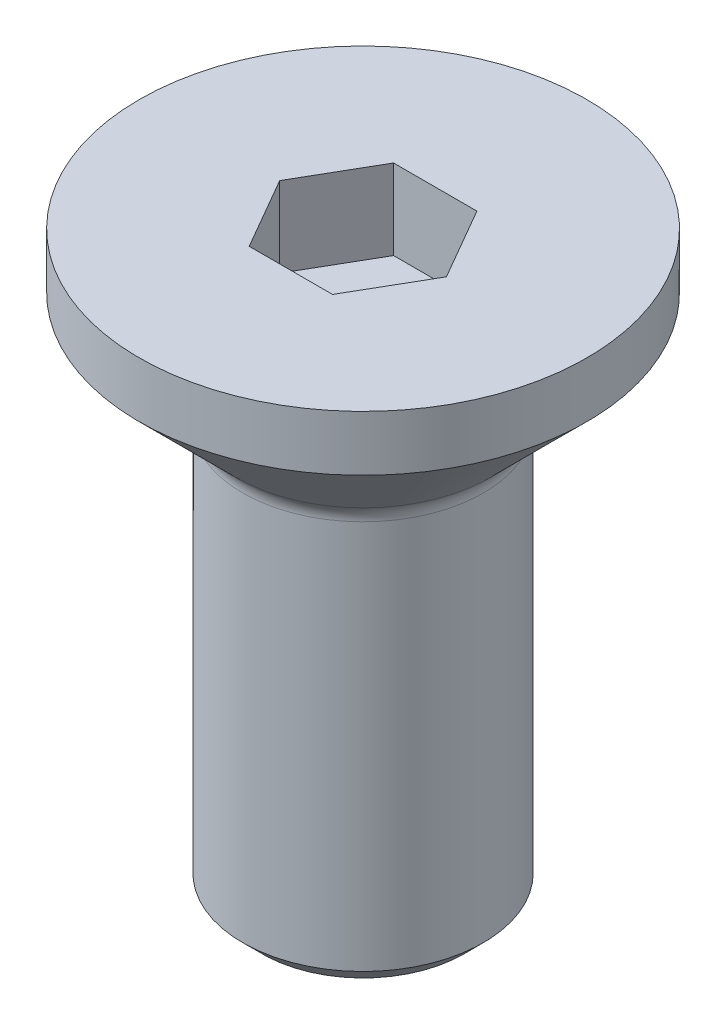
ISO-10303-21;
HEADER;
FILE_DESCRIPTION(('STEP AP214'),'2;1');
FILE_NAME('part.step','',(''),(''),'','','');
FILE_SCHEMA(('AUTOMOTIVE_DESIGN { 1 0 10303 214 1 1 1 1 }'));
ENDSEC;
DATA;
#1=APPLICATION_CONTEXT('core data for automotive mechanical design processes');
#2=APPLICATION_PROTOCOL_DEFINITION('international standard','automotive_design',2000,#1);
#3=PRODUCT_CONTEXT('',#1,'mechanical');
#4=PRODUCT('Part','Part','',(#3));
#5=PRODUCT_RELATED_PRODUCT_CATEGORY('part','',(#4));
#6=PRODUCT_DEFINITION_FORMATION('','',#4);
#7=PRODUCT_DEFINITION_CONTEXT('part definition',#1,'design');
#8=PRODUCT_DEFINITION('design','',#6,#7);
#9=PRODUCT_DEFINITION_SHAPE('','',#8);
#10=(LENGTH_UNIT() NAMED_UNIT(*) SI_UNIT(.MILLI.,.METRE.));
#11=(NAMED_UNIT(*) PLANE_ANGLE_UNIT() SI_UNIT($,.RADIAN.));
#12=(NAMED_UNIT(*) SI_UNIT($,.STERADIAN.) SOLID_ANGLE_UNIT());
#13=UNCERTAINTY_MEASURE_WITH_UNIT(LENGTH_MEASURE(1.E-05),#10,'distance_accuracy_value','');
#14=(GEOMETRIC_REPRESENTATION_CONTEXT(3) GLOBAL_UNCERTAINTY_ASSIGNED_CONTEXT((#13)) GLOBAL_UNIT_ASSIGNED_CONTEXT((#10,
#11,#12)) REPRESENTATION_CONTEXT('',''));
#15=CARTESIAN_POINT('',(0.,0.,0.));
#16=DIRECTION('',(0.,0.,1.));
#17=DIRECTION('',(1.,0.,0.));
#18=AXIS2_PLACEMENT_3D('',#15,#16,#17);
#19=CARTESIAN_POINT('',(0.,-3.50710678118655,0.));
#20=DIRECTION('',(0.,1.,0.));
#21=DIRECTION('',(-1.,0.,0.));
#22=AXIS2_PLACEMENT_3D('',#19,#20,#21);
#23=TOROIDAL_SURFACE('',#22,3.,0.499999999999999);
#24=CARTESIAN_POINT('',(0.,-3.15355339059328,0.));
#25=DIRECTION('',(0.,1.,0.));
#26=DIRECTION('',(-1.,0.,0.));
#27=AXIS2_PLACEMENT_3D('',#24,#25,#26);
#28=CIRCLE('',#27,2.64644660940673);
#29=CARTESIAN_POINT('',(-2.64644660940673,-3.15355339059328,0.));
#30=VERTEX_POINT('',#29);
#31=EDGE_CURVE('E11',#30,#30,#28,.T.);
#32=ORIENTED_EDGE('',*,*,#31,.F.);
#33=EDGE_LOOP('',(#32));
#34=FACE_BOUND('',#33,.T.);
#35=CARTESIAN_POINT('',(0.,-3.50710678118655,0.));
#36=DIRECTION('',(0.,1.,0.));
#37=DIRECTION('',(-1.,0.,0.));
#38=AXIS2_PLACEMENT_3D('',#35,#36,#37);
#39=CIRCLE('',#38,2.5);
#40=CARTESIAN_POINT('',(-2.5,-3.50710678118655,0.));
#41=VERTEX_POINT('',#40);
#42=EDGE_CURVE('E140',#41,#41,#39,.T.);
#43=ORIENTED_EDGE('',*,*,#42,.T.);
#44=EDGE_LOOP('',(#43));
#45=FACE_BOUND('',#44,.T.);
#46=ADVANCED_FACE('F39',(#34,#45),#23,.F.);
#47=CARTESIAN_POINT('',(0.,-3.15355339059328,0.));
#48=DIRECTION('',(0.,1.,0.));
#49=DIRECTION('',(-1.,0.,0.));
#50=AXIS2_PLACEMENT_3D('',#47,#48,#49);
#51=CONICAL_SURFACE('',#50,2.64644660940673,0.78539816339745);
#52=CARTESIAN_POINT('',(0.,-1.15000000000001,0.));
#53=DIRECTION('',(0.,1.,0.));
#54=DIRECTION('',(-1.,0.,0.));
#55=AXIS2_PLACEMENT_3D('',#52,#53,#54);
#56=CIRCLE('',#55,4.65);
#57=CARTESIAN_POINT('',(-4.65,-1.15000000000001,0.));
#58=VERTEX_POINT('',#57);
#59=EDGE_CURVE('E46',#58,#58,#56,.T.);
#60=ORIENTED_EDGE('',*,*,#59,.F.);
#61=EDGE_LOOP('',(#60));
#62=FACE_BOUND('',#61,.T.);
#63=ORIENTED_EDGE('',*,*,#31,.T.);
#64=EDGE_LOOP('',(#63));
#65=FACE_BOUND('',#64,.T.);
#66=ADVANCED_FACE('F161',(#62,#65),#51,.T.);
#67=CARTESIAN_POINT('',(0.,0.,0.));
#68=DIRECTION('',(0.,1.,0.));
#69=DIRECTION('',(-1.,0.,0.));
#70=AXIS2_PLACEMENT_3D('',#67,#68,#69);
#71=CYLINDRICAL_SURFACE('',#70,4.65);
#72=CARTESIAN_POINT('',(0.,0.,0.));
#73=DIRECTION('',(0.,1.,0.));
#74=DIRECTION('',(-1.,0.,0.));
#75=AXIS2_PLACEMENT_3D('',#72,#73,#74);
#76=CIRCLE('',#75,4.65);
#77=CARTESIAN_POINT('',(-4.65,0.,0.));
#78=VERTEX_POINT('',#77);
#79=EDGE_CURVE('E154',#78,#78,#76,.T.);
#80=ORIENTED_EDGE('',*,*,#79,.F.);
#81=EDGE_LOOP('',(#80));
#82=FACE_BOUND('',#81,.T.);
#83=ORIENTED_EDGE('',*,*,#59,.T.);
#84=EDGE_LOOP('',(#83));
#85=FACE_BOUND('',#84,.T.);
#86=ADVANCED_FACE('F159',(#82,#85),#71,.T.);
#87=CARTESIAN_POINT('',(4.65,0.,0.));
#88=DIRECTION('',(0.,-1.,0.));
#89=DIRECTION('',(1.,0.,0.));
#90=AXIS2_PLACEMENT_3D('',#87,#88,#89);
#91=PLANE('',#90);
#92=DIRECTION('',(-0.5,0.,-0.866025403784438));
#93=VECTOR('',#92,1.);
#94=CARTESIAN_POINT('',(1.73205080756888,0.,0.));
#95=LINE('',#94,#93);
#96=CARTESIAN_POINT('',(1.73205080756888,0.,0.));
#97=VERTEX_POINT('',#96);
#98=CARTESIAN_POINT('',(0.866025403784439,0.,-1.5));
#99=VERTEX_POINT('',#98);
#100=EDGE_CURVE('E127',#97,#99,#95,.T.);
#101=ORIENTED_EDGE('',*,*,#100,.F.);
#102=DIRECTION('',(0.5,0.,-0.866025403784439));
#103=VECTOR('',#102,1.);
#104=CARTESIAN_POINT('',(0.86602540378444,0.,1.5));
#105=LINE('',#104,#103);
#106=CARTESIAN_POINT('',(0.86602540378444,0.,1.5));
#107=VERTEX_POINT('',#106);
#108=EDGE_CURVE('E53',#107,#97,#105,.T.);
#109=ORIENTED_EDGE('',*,*,#108,.F.);
#110=DIRECTION('',(1.,0.,0.));
#111=VECTOR('',#110,1.);
#112=CARTESIAN_POINT('',(-0.866025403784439,0.,1.5));
#113=LINE('',#112,#111);
#114=CARTESIAN_POINT('',(-0.866025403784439,0.,1.5));
#115=VERTEX_POINT('',#114);
#116=EDGE_CURVE('E136',#115,#107,#113,.T.);
#117=ORIENTED_EDGE('',*,*,#116,.F.);
#118=DIRECTION('',(0.5,0.,0.866025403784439));
#119=VECTOR('',#118,1.);
#120=CARTESIAN_POINT('',(-1.73205080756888,0.,0.));
#121=LINE('',#120,#119);
#122=CARTESIAN_POINT('',(-1.73205080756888,0.,0.));
#123=VERTEX_POINT('',#122);
#124=EDGE_CURVE('E134',#123,#115,#121,.T.);
#125=ORIENTED_EDGE('',*,*,#124,.F.);
#126=DIRECTION('',(-0.5,0.,0.866025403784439));
#127=VECTOR('',#126,1.);
#128=CARTESIAN_POINT('',(-0.866025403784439,0.,-1.5));
#129=LINE('',#128,#127);
#130=CARTESIAN_POINT('',(-0.866025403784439,0.,-1.5));
#131=VERTEX_POINT('',#130);
#132=EDGE_CURVE('E101',#131,#123,#129,.T.);
#133=ORIENTED_EDGE('',*,*,#132,.F.);
#134=DIRECTION('',(-1.,0.,0.));
#135=VECTOR('',#134,1.);
#136=CARTESIAN_POINT('',(0.866025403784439,0.,-1.5));
#137=LINE('',#136,#135);
#138=EDGE_CURVE('E130',#99,#131,#137,.T.);
#139=ORIENTED_EDGE('',*,*,#138,.F.);
#140=EDGE_LOOP('',(#101,#109,#117,#125,#133,#139));
#141=FACE_BOUND('',#140,.T.);
#142=ORIENTED_EDGE('',*,*,#79,.T.);
#143=EDGE_LOOP('',(#142));
#144=FACE_BOUND('',#143,.T.);
#145=ADVANCED_FACE('F185',(#141,#144),#91,.F.);
#146=CARTESIAN_POINT('',(2.1,-12.,0.));
#147=DIRECTION('',(0.,1.,0.));
#148=DIRECTION('',(-1.,0.,0.));
#149=AXIS2_PLACEMENT_3D('',#146,#147,#148);
#150=PLANE('',#149);
#151=CARTESIAN_POINT('',(0.,-12.,0.));
#152=DIRECTION('',(0.,1.,0.));
#153=DIRECTION('',(-1.,0.,0.));
#154=AXIS2_PLACEMENT_3D('',#151,#152,#153);
#155=CIRCLE('',#154,2.1);
#156=CARTESIAN_POINT('',(-2.1,-12.,0.));
#157=VERTEX_POINT('',#156);
#158=EDGE_CURVE('E151',#157,#157,#155,.T.);
#159=ORIENTED_EDGE('',*,*,#158,.F.);
#160=EDGE_LOOP('',(#159));
#161=FACE_BOUND('',#160,.T.);
#162=ADVANCED_FACE('F180',(#161),#150,.F.);
#163=CARTESIAN_POINT('',(0.,-12.,0.));
#164=DIRECTION('',(0.,1.,0.));
#165=DIRECTION('',(-1.,0.,0.));
#166=AXIS2_PLACEMENT_3D('',#163,#164,#165);
#167=CONICAL_SURFACE('',#166,2.1,0.785398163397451);
#168=CARTESIAN_POINT('',(0.,-11.6,0.));
#169=DIRECTION('',(0.,1.,0.));
#170=DIRECTION('',(-1.,0.,0.));
#171=AXIS2_PLACEMENT_3D('',#168,#169,#170);
#172=CIRCLE('',#171,2.5);
#173=CARTESIAN_POINT('',(-2.5,-11.6,0.));
#174=VERTEX_POINT('',#173);
#175=EDGE_CURVE('E148',#174,#174,#172,.T.);
#176=ORIENTED_EDGE('',*,*,#175,.F.);
#177=EDGE_LOOP('',(#176));
#178=FACE_BOUND('',#177,.T.);
#179=ORIENTED_EDGE('',*,*,#158,.T.);
#180=EDGE_LOOP('',(#179));
#181=FACE_BOUND('',#180,.T.);
#182=ADVANCED_FACE('F174',(#178,#181),#167,.T.);
#183=CARTESIAN_POINT('',(0.,0.,0.));
#184=DIRECTION('',(0.,1.,0.));
#185=DIRECTION('',(-1.,0.,0.));
#186=AXIS2_PLACEMENT_3D('',#183,#184,#185);
#187=CYLINDRICAL_SURFACE('',#186,2.5);
#188=ORIENTED_EDGE('',*,*,#42,.F.);
#189=EDGE_LOOP('',(#188));
#190=FACE_BOUND('',#189,.T.);
#191=ORIENTED_EDGE('',*,*,#175,.T.);
#192=EDGE_LOOP('',(#191));
#193=FACE_BOUND('',#192,.T.);
#194=ADVANCED_FACE('F170',(#190,#193),#187,.T.);
#195=CARTESIAN_POINT('',(0.86602540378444,-1.66666666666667,1.5));
#196=DIRECTION('',(0.866025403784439,0.,0.5));
#197=DIRECTION('',(0.5,0.,-0.866025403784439));
#198=AXIS2_PLACEMENT_3D('',#195,#196,#197);
#199=PLANE('',#198);
#200=ORIENTED_EDGE('',*,*,#108,.T.);
#201=DIRECTION('',(0.,1.,0.));
#202=VECTOR('',#201,1.);
#203=CARTESIAN_POINT('',(1.73205080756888,-1.66666666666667,0.));
#204=LINE('',#203,#202);
#205=CARTESIAN_POINT('',(1.73205080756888,-1.66666666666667,0.));
#206=VERTEX_POINT('',#205);
#207=EDGE_CURVE('E83',#206,#97,#204,.T.);
#208=ORIENTED_EDGE('',*,*,#207,.F.);
#209=DIRECTION('',(0.5,0.,-0.866025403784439));
#210=VECTOR('',#209,1.);
#211=CARTESIAN_POINT('',(0.86602540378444,-1.66666666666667,1.5));
#212=LINE('',#211,#210);
#213=CARTESIAN_POINT('',(0.86602540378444,-1.66666666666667,1.5));
#214=VERTEX_POINT('',#213);
#215=EDGE_CURVE('E138',#214,#206,#212,.T.);
#216=ORIENTED_EDGE('',*,*,#215,.F.);
#217=DIRECTION('',(0.,1.,0.));
#218=VECTOR('',#217,1.);
#219=CARTESIAN_POINT('',(0.86602540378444,-1.66666666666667,1.5));
#220=LINE('',#219,#218);
#221=EDGE_CURVE('E61',#214,#107,#220,.T.);
#222=ORIENTED_EDGE('',*,*,#221,.T.);
#223=EDGE_LOOP('',(#200,#208,#216,#222));
#224=FACE_BOUND('',#223,.T.);
#225=ADVANCED_FACE('F173',(#224),#199,.F.);
#226=CARTESIAN_POINT('',(-0.866025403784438,-1.66666666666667,1.5));
#227=DIRECTION('',(0.,0.,1.));
#228=DIRECTION('',(1.,0.,0.));
#229=AXIS2_PLACEMENT_3D('',#226,#227,#228);
#230=PLANE('',#229);
#231=ORIENTED_EDGE('',*,*,#116,.T.);
#232=ORIENTED_EDGE('',*,*,#221,.F.);
#233=DIRECTION('',(1.,0.,0.));
#234=VECTOR('',#233,1.);
#235=CARTESIAN_POINT('',(-0.866025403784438,-1.66666666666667,1.5));
#236=LINE('',#235,#234);
#237=CARTESIAN_POINT('',(-0.866025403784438,-1.66666666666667,1.5));
#238=VERTEX_POINT('',#237);
#239=EDGE_CURVE('E113',#238,#214,#236,.T.);
#240=ORIENTED_EDGE('',*,*,#239,.F.);
#241=DIRECTION('',(0.,1.,0.));
#242=VECTOR('',#241,1.);
#243=CARTESIAN_POINT('',(-0.866025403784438,-1.66666666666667,1.5));
#244=LINE('',#243,#242);
#245=EDGE_CURVE('E105',#238,#115,#244,.T.);
#246=ORIENTED_EDGE('',*,*,#245,.T.);
#247=EDGE_LOOP('',(#231,#232,#240,#246));
#248=FACE_BOUND('',#247,.T.);
#249=ADVANCED_FACE('F220',(#248),#230,.F.);
#250=CARTESIAN_POINT('',(-1.73205080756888,-1.66666666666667,0.));
#251=DIRECTION('',(-0.866025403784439,0.,0.5));
#252=DIRECTION('',(0.5,0.,0.866025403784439));
#253=AXIS2_PLACEMENT_3D('',#250,#251,#252);
#254=PLANE('',#253);
#255=ORIENTED_EDGE('',*,*,#124,.T.);
#256=ORIENTED_EDGE('',*,*,#245,.F.);
#257=DIRECTION('',(0.5,0.,0.866025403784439));
#258=VECTOR('',#257,1.);
#259=CARTESIAN_POINT('',(-1.73205080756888,-1.66666666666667,0.));
#260=LINE('',#259,#258);
#261=CARTESIAN_POINT('',(-1.73205080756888,-1.66666666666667,0.));
#262=VERTEX_POINT('',#261);
#263=EDGE_CURVE('E109',#262,#238,#260,.T.);
#264=ORIENTED_EDGE('',*,*,#263,.F.);
#265=DIRECTION('',(0.,1.,0.));
#266=VECTOR('',#265,1.);
#267=CARTESIAN_POINT('',(-1.73205080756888,-1.66666666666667,0.));
#268=LINE('',#267,#266);
#269=EDGE_CURVE('E94',#262,#123,#268,.T.);
#270=ORIENTED_EDGE('',*,*,#269,.T.);
#271=EDGE_LOOP('',(#255,#256,#264,#270));
#272=FACE_BOUND('',#271,.T.);
#273=ADVANCED_FACE('F110',(#272),#254,.F.);
#274=CARTESIAN_POINT('',(-0.866025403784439,-1.66666666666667,-1.5));
#275=DIRECTION('',(-0.866025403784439,0.,-0.5));
#276=DIRECTION('',(-0.5,0.,0.866025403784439));
#277=AXIS2_PLACEMENT_3D('',#274,#275,#276);
#278=PLANE('',#277);
#279=ORIENTED_EDGE('',*,*,#132,.T.);
#280=ORIENTED_EDGE('',*,*,#269,.F.);
#281=DIRECTION('',(-0.5,0.,0.866025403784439));
#282=VECTOR('',#281,1.);
#283=CARTESIAN_POINT('',(-0.866025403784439,-1.66666666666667,-1.5));
#284=LINE('',#283,#282);
#285=CARTESIAN_POINT('',(-0.866025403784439,-1.66666666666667,-1.5));
#286=VERTEX_POINT('',#285);
#287=EDGE_CURVE('E98',#286,#262,#284,.T.);
#288=ORIENTED_EDGE('',*,*,#287,.F.);
#289=DIRECTION('',(0.,1.,0.));
#290=VECTOR('',#289,1.);
#291=CARTESIAN_POINT('',(-0.866025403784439,-1.66666666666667,-1.5));
#292=LINE('',#291,#290);
#293=EDGE_CURVE('E106',#286,#131,#292,.T.);
#294=ORIENTED_EDGE('',*,*,#293,.T.);
#295=EDGE_LOOP('',(#279,#280,#288,#294));
#296=FACE_BOUND('',#295,.T.);
#297=ADVANCED_FACE('F96',(#296),#278,.F.);
#298=CARTESIAN_POINT('',(0.866025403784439,-1.66666666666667,-1.5));
#299=DIRECTION('',(0.,0.,-1.));
#300=DIRECTION('',(-1.,0.,0.));
#301=AXIS2_PLACEMENT_3D('',#298,#299,#300);
#302=PLANE('',#301);
#303=ORIENTED_EDGE('',*,*,#138,.T.);
#304=ORIENTED_EDGE('',*,*,#293,.F.);
#305=DIRECTION('',(-1.,0.,0.));
#306=VECTOR('',#305,1.);
#307=CARTESIAN_POINT('',(0.866025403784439,-1.66666666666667,-1.5));
#308=LINE('',#307,#306);
#309=CARTESIAN_POINT('',(0.866025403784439,-1.66666666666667,-1.5));
#310=VERTEX_POINT('',#309);
#311=EDGE_CURVE('E119',#310,#286,#308,.T.);
#312=ORIENTED_EDGE('',*,*,#311,.F.);
#313=DIRECTION('',(0.,1.,0.));
#314=VECTOR('',#313,1.);
#315=CARTESIAN_POINT('',(0.866025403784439,-1.66666666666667,-1.5));
#316=LINE('',#315,#314);
#317=EDGE_CURVE('E143',#310,#99,#316,.T.);
#318=ORIENTED_EDGE('',*,*,#317,.T.);
#319=EDGE_LOOP('',(#303,#304,#312,#318));
#320=FACE_BOUND('',#319,.T.);
#321=ADVANCED_FACE('F245',(#320),#302,.F.);
#322=CARTESIAN_POINT('',(1.73205080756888,-1.66666666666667,0.));
#323=DIRECTION('',(0.866025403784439,0.,-0.5));
#324=DIRECTION('',(-0.5,0.,-0.866025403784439));
#325=AXIS2_PLACEMENT_3D('',#322,#323,#324);
#326=PLANE('',#325);
#327=ORIENTED_EDGE('',*,*,#100,.T.);
#328=ORIENTED_EDGE('',*,*,#317,.F.);
#329=DIRECTION('',(-0.5,0.,-0.866025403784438));
#330=VECTOR('',#329,1.);
#331=CARTESIAN_POINT('',(1.73205080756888,-1.66666666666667,0.));
#332=LINE('',#331,#330);
#333=EDGE_CURVE('E121',#206,#310,#332,.T.);
#334=ORIENTED_EDGE('',*,*,#333,.F.);
#335=ORIENTED_EDGE('',*,*,#207,.T.);
#336=EDGE_LOOP('',(#327,#328,#334,#335));
#337=FACE_BOUND('',#336,.T.);
#338=ADVANCED_FACE('F254',(#337),#326,.F.);
#339=CARTESIAN_POINT('',(1.73205080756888,-1.66666666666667,0.));
#340=DIRECTION('',(0.,1.,0.));
#341=DIRECTION('',(-1.,0.,0.));
#342=AXIS2_PLACEMENT_3D('',#339,#340,#341);
#343=PLANE('',#342);
#344=ORIENTED_EDGE('',*,*,#215,.T.);
#345=ORIENTED_EDGE('',*,*,#333,.T.);
#346=ORIENTED_EDGE('',*,*,#311,.T.);
#347=ORIENTED_EDGE('',*,*,#287,.T.);
#348=ORIENTED_EDGE('',*,*,#263,.T.);
#349=ORIENTED_EDGE('',*,*,#239,.T.);
#350=EDGE_LOOP('',(#344,#345,#346,#347,#348,#349));
#351=FACE_BOUND('',#350,.T.);
#352=ADVANCED_FACE('F116',(#351),#343,.T.);
#353=CLOSED_SHELL('',(#46,#66,#86,#145,#162,#182,#194,#225,#249,#273,#297,#321,#338,#352));
#354=MANIFOLD_SOLID_BREP('B2',#353);
#355=ADVANCED_BREP_SHAPE_REPRESENTATION('',(#18,#354),#14);
#356=SHAPE_DEFINITION_REPRESENTATION(#9,#355);
ENDSEC;
END-ISO-10303-21;
